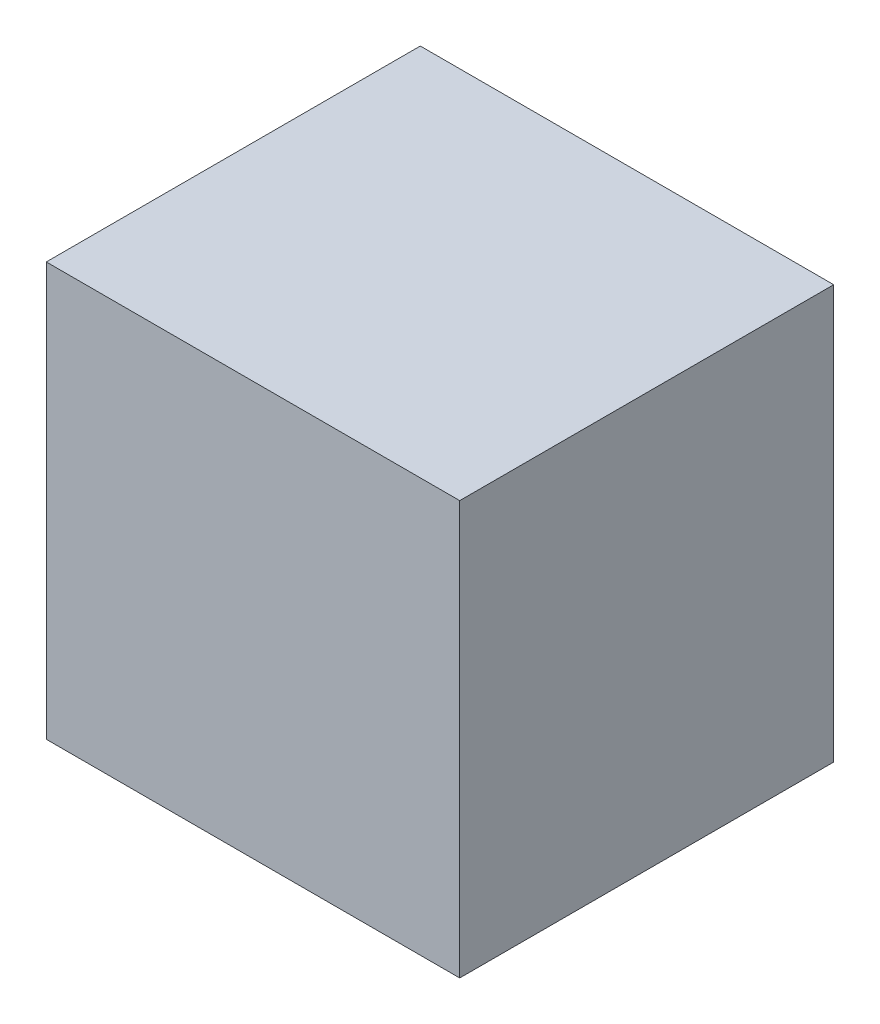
ISO-10303-21;
HEADER;
FILE_DESCRIPTION(('STEP AP214'),'2;1');
FILE_NAME('part.step','',(''),(''),'','','');
FILE_SCHEMA(('AUTOMOTIVE_DESIGN { 1 0 10303 214 1 1 1 1 }'));
ENDSEC;
DATA;
#1=APPLICATION_CONTEXT('core data for automotive mechanical design processes');
#2=APPLICATION_PROTOCOL_DEFINITION('international standard','automotive_design',2000,#1);
#3=PRODUCT_CONTEXT('',#1,'mechanical');
#4=PRODUCT('Part','Part','',(#3));
#5=PRODUCT_RELATED_PRODUCT_CATEGORY('part','',(#4));
#6=PRODUCT_DEFINITION_FORMATION('','',#4);
#7=PRODUCT_DEFINITION_CONTEXT('part definition',#1,'design');
#8=PRODUCT_DEFINITION('design','',#6,#7);
#9=PRODUCT_DEFINITION_SHAPE('','',#8);
#10=(LENGTH_UNIT() NAMED_UNIT(*) SI_UNIT(.MILLI.,.METRE.));
#11=(NAMED_UNIT(*) PLANE_ANGLE_UNIT() SI_UNIT($,.RADIAN.));
#12=(NAMED_UNIT(*) SI_UNIT($,.STERADIAN.) SOLID_ANGLE_UNIT());
#13=UNCERTAINTY_MEASURE_WITH_UNIT(LENGTH_MEASURE(1.E-05),#10,'distance_accuracy_value','');
#14=(GEOMETRIC_REPRESENTATION_CONTEXT(3) GLOBAL_UNCERTAINTY_ASSIGNED_CONTEXT((#13)) GLOBAL_UNIT_ASSIGNED_CONTEXT((#10,
#11,#12)) REPRESENTATION_CONTEXT('',''));
#15=CARTESIAN_POINT('',(0.,0.,0.));
#16=DIRECTION('',(0.,0.,1.));
#17=DIRECTION('',(1.,0.,0.));
#18=AXIS2_PLACEMENT_3D('',#15,#16,#17);
#19=CARTESIAN_POINT('',(0.,0.,25.7992760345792));
#20=DIRECTION('',(1.,0.,0.));
#21=DIRECTION('',(0.,0.,-1.));
#22=AXIS2_PLACEMENT_3D('',#19,#20,#21);
#23=PLANE('',#22);
#24=DIRECTION('',(0.,-1.,0.));
#25=VECTOR('',#24,1.);
#26=CARTESIAN_POINT('',(0.,0.,-25.7992760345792));
#27=LINE('',#26,#25);
#28=CARTESIAN_POINT('',(0.,57.0394912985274,-25.7992760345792));
#29=VERTEX_POINT('',#28);
#30=CARTESIAN_POINT('',(0.,0.,-25.7992760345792));
#31=VERTEX_POINT('',#30);
#32=EDGE_CURVE('E75',#29,#31,#27,.T.);
#33=ORIENTED_EDGE('',*,*,#32,.T.);
#34=DIRECTION('',(0.,0.,-1.));
#35=VECTOR('',#34,1.);
#36=CARTESIAN_POINT('',(0.,0.,25.7992760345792));
#37=LINE('',#36,#35);
#38=CARTESIAN_POINT('',(0.,0.,25.7992760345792));
#39=VERTEX_POINT('',#38);
#40=EDGE_CURVE('E11',#39,#31,#37,.T.);
#41=ORIENTED_EDGE('',*,*,#40,.F.);
#42=DIRECTION('',(0.,-1.,0.));
#43=VECTOR('',#42,1.);
#44=CARTESIAN_POINT('',(0.,0.,25.7992760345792));
#45=LINE('',#44,#43);
#46=CARTESIAN_POINT('',(0.,57.0394912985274,25.7992760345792));
#47=VERTEX_POINT('',#46);
#48=EDGE_CURVE('E93',#47,#39,#45,.T.);
#49=ORIENTED_EDGE('',*,*,#48,.F.);
#50=DIRECTION('',(0.,0.,-1.));
#51=VECTOR('',#50,1.);
#52=CARTESIAN_POINT('',(0.,57.0394912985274,25.7992760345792));
#53=LINE('',#52,#51);
#54=EDGE_CURVE('E87',#47,#29,#53,.T.);
#55=ORIENTED_EDGE('',*,*,#54,.T.);
#56=EDGE_LOOP('',(#33,#41,#49,#55));
#57=FACE_BOUND('',#56,.T.);
#58=ADVANCED_FACE('F31',(#57),#23,.F.);
#59=CARTESIAN_POINT('',(0.,0.,25.7992760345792));
#60=DIRECTION('',(0.,1.,0.));
#61=DIRECTION('',(0.,0.,1.));
#62=AXIS2_PLACEMENT_3D('',#59,#60,#61);
#63=PLANE('',#62);
#64=DIRECTION('',(1.,0.,0.));
#65=VECTOR('',#64,1.);
#66=CARTESIAN_POINT('',(0.,0.,-25.7992760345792));
#67=LINE('',#66,#65);
#68=CARTESIAN_POINT('',(57.0394912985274,0.,-25.7992760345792));
#69=VERTEX_POINT('',#68);
#70=EDGE_CURVE('E71',#31,#69,#67,.T.);
#71=ORIENTED_EDGE('',*,*,#70,.T.);
#72=DIRECTION('',(0.,0.,-1.));
#73=VECTOR('',#72,1.);
#74=CARTESIAN_POINT('',(57.0394912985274,0.,25.7992760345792));
#75=LINE('',#74,#73);
#76=CARTESIAN_POINT('',(57.0394912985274,0.,25.7992760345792));
#77=VERTEX_POINT('',#76);
#78=EDGE_CURVE('E38',#77,#69,#75,.T.);
#79=ORIENTED_EDGE('',*,*,#78,.F.);
#80=DIRECTION('',(1.,0.,0.));
#81=VECTOR('',#80,1.);
#82=CARTESIAN_POINT('',(0.,0.,25.7992760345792));
#83=LINE('',#82,#81);
#84=EDGE_CURVE('E83',#39,#77,#83,.T.);
#85=ORIENTED_EDGE('',*,*,#84,.F.);
#86=ORIENTED_EDGE('',*,*,#40,.T.);
#87=EDGE_LOOP('',(#71,#79,#85,#86));
#88=FACE_BOUND('',#87,.T.);
#89=ADVANCED_FACE('F82',(#88),#63,.F.);
#90=CARTESIAN_POINT('',(57.0394912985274,0.,25.7992760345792));
#91=DIRECTION('',(-1.,0.,0.));
#92=DIRECTION('',(0.,0.,1.));
#93=AXIS2_PLACEMENT_3D('',#90,#91,#92);
#94=PLANE('',#93);
#95=DIRECTION('',(0.,1.,0.));
#96=VECTOR('',#95,1.);
#97=CARTESIAN_POINT('',(57.0394912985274,0.,-25.7992760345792));
#98=LINE('',#97,#96);
#99=CARTESIAN_POINT('',(57.0394912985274,57.0394912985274,-25.7992760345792));
#100=VERTEX_POINT('',#99);
#101=EDGE_CURVE('E76',#69,#100,#98,.T.);
#102=ORIENTED_EDGE('',*,*,#101,.T.);
#103=DIRECTION('',(0.,0.,-1.));
#104=VECTOR('',#103,1.);
#105=CARTESIAN_POINT('',(57.0394912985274,57.0394912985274,25.7992760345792));
#106=LINE('',#105,#104);
#107=CARTESIAN_POINT('',(57.0394912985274,57.0394912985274,25.7992760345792));
#108=VERTEX_POINT('',#107);
#109=EDGE_CURVE('E99',#108,#100,#106,.T.);
#110=ORIENTED_EDGE('',*,*,#109,.F.);
#111=DIRECTION('',(0.,1.,0.));
#112=VECTOR('',#111,1.);
#113=CARTESIAN_POINT('',(57.0394912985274,0.,25.7992760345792));
#114=LINE('',#113,#112);
#115=EDGE_CURVE('E50',#77,#108,#114,.T.);
#116=ORIENTED_EDGE('',*,*,#115,.F.);
#117=ORIENTED_EDGE('',*,*,#78,.T.);
#118=EDGE_LOOP('',(#102,#110,#116,#117));
#119=FACE_BOUND('',#118,.T.);
#120=ADVANCED_FACE('F102',(#119),#94,.F.);
#121=CARTESIAN_POINT('',(0.,57.0394912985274,25.7992760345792));
#122=DIRECTION('',(0.,-1.,0.));
#123=DIRECTION('',(1.,0.,0.));
#124=AXIS2_PLACEMENT_3D('',#121,#122,#123);
#125=PLANE('',#124);
#126=DIRECTION('',(-1.,0.,0.));
#127=VECTOR('',#126,1.);
#128=CARTESIAN_POINT('',(0.,57.0394912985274,-25.7992760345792));
#129=LINE('',#128,#127);
#130=EDGE_CURVE('E91',#100,#29,#129,.T.);
#131=ORIENTED_EDGE('',*,*,#130,.T.);
#132=ORIENTED_EDGE('',*,*,#54,.F.);
#133=DIRECTION('',(-1.,0.,0.));
#134=VECTOR('',#133,1.);
#135=CARTESIAN_POINT('',(0.,57.0394912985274,25.7992760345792));
#136=LINE('',#135,#134);
#137=EDGE_CURVE('E45',#108,#47,#136,.T.);
#138=ORIENTED_EDGE('',*,*,#137,.F.);
#139=ORIENTED_EDGE('',*,*,#109,.T.);
#140=EDGE_LOOP('',(#131,#132,#138,#139));
#141=FACE_BOUND('',#140,.T.);
#142=ADVANCED_FACE('F104',(#141),#125,.F.);
#143=CARTESIAN_POINT('',(0.,0.,25.7992760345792));
#144=DIRECTION('',(0.,0.,-1.));
#145=DIRECTION('',(-1.,0.,0.));
#146=AXIS2_PLACEMENT_3D('',#143,#144,#145);
#147=PLANE('',#146);
#148=ORIENTED_EDGE('',*,*,#48,.T.);
#149=ORIENTED_EDGE('',*,*,#84,.T.);
#150=ORIENTED_EDGE('',*,*,#115,.T.);
#151=ORIENTED_EDGE('',*,*,#137,.T.);
#152=EDGE_LOOP('',(#148,#149,#150,#151));
#153=FACE_BOUND('',#152,.T.);
#154=ADVANCED_FACE('F105',(#153),#147,.F.);
#155=CARTESIAN_POINT('',(0.,0.,-25.7992760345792));
#156=DIRECTION('',(0.,0.,-1.));
#157=DIRECTION('',(-1.,0.,0.));
#158=AXIS2_PLACEMENT_3D('',#155,#156,#157);
#159=PLANE('',#158);
#160=ORIENTED_EDGE('',*,*,#32,.F.);
#161=ORIENTED_EDGE('',*,*,#130,.F.);
#162=ORIENTED_EDGE('',*,*,#101,.F.);
#163=ORIENTED_EDGE('',*,*,#70,.F.);
#164=EDGE_LOOP('',(#160,#161,#162,#163));
#165=FACE_BOUND('',#164,.T.);
#166=ADVANCED_FACE('F72',(#165),#159,.T.);
#167=CLOSED_SHELL('',(#58,#89,#120,#142,#154,#166));
#168=MANIFOLD_SOLID_BREP('B2',#167);
#169=ADVANCED_BREP_SHAPE_REPRESENTATION('',(#18,#168),#14);
#170=SHAPE_DEFINITION_REPRESENTATION(#9,#169);
ENDSEC;
END-ISO-10303-21;
